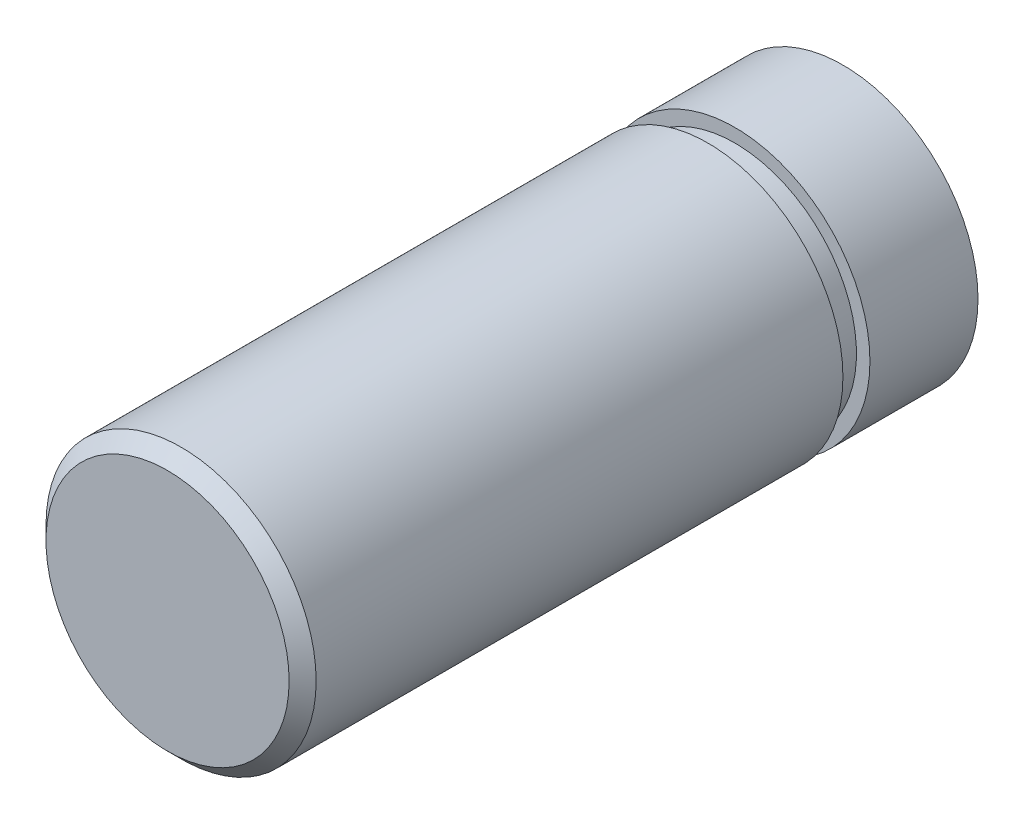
from build123d import *

# Parameters (mm, degrees)
ESQUISSE1_R      = 10
EXTRUSION1_DEPTH = 50
CHANFREIN1_SIZE  = 1
ESQUISSE2_W      = 2
ESQUISSE2_H      = 1


with BuildPart() as part:
    # Esquisse1 → Extrusion1 (new body)
    with BuildSketch(Plane.XY):
        Circle(ESQUISSE1_R)
    extrude(amount=EXTRUSION1_DEPTH)

    # Chanfrein1
    chanfrein1_edges = [part.edges().sort_by_distance(p)[0] for p in [
        (-10, 0, 50),
    ]]
    chamfer(chanfrein1_edges, length=CHANFREIN1_SIZE)

    # Esquisse2 → Enl_vement de mati_re-R_volution1 (revolve, cut)
    with BuildSketch(Plane(origin=(0, 0, 0), x_dir=(0, 0, -1), z_dir=(1, 0, 0)), mode=Mode.PRIVATE) as enl_vement_de_mati_re_r_volution1_sk:
        with Locations((-9, 9.5)):
            Rectangle(ESQUISSE2_W, ESQUISSE2_H)
    revolve(enl_vement_de_mati_re_r_volution1_sk.sketch.rotate(Axis((0, 0, -0.517171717), (0, 0, 1)), 90), axis=Axis((0, 0, -0.517171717), (0, 0, 1)), mode=Mode.SUBTRACT)


solid = part.part
